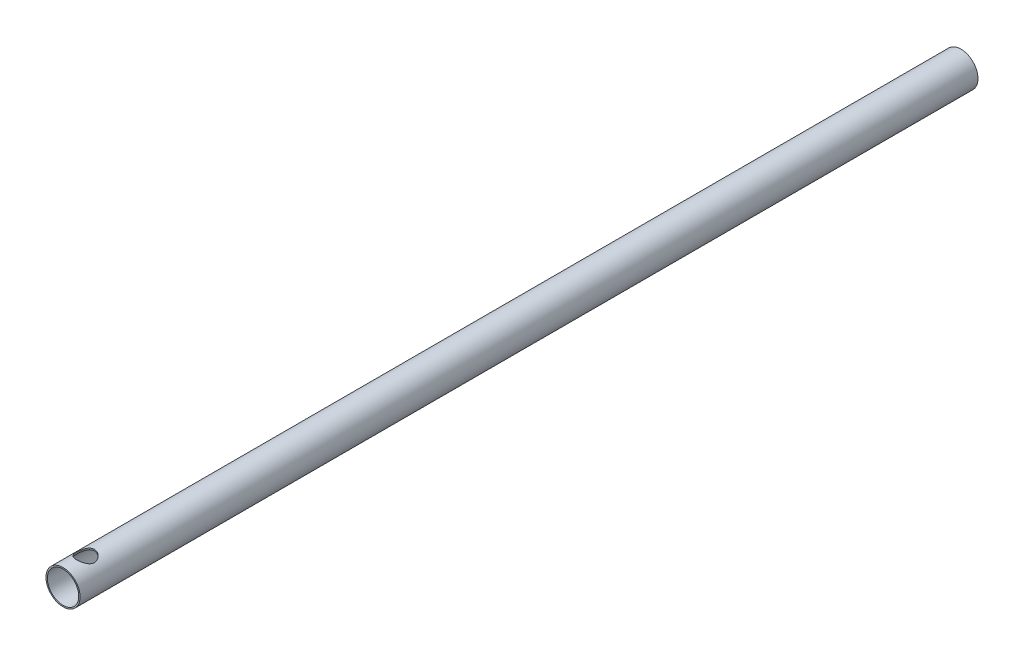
ISO-10303-21;
HEADER;
FILE_DESCRIPTION(('STEP AP214'),'2;1');
FILE_NAME('part.step','',(''),(''),'','','');
FILE_SCHEMA(('AUTOMOTIVE_DESIGN { 1 0 10303 214 1 1 1 1 }'));
ENDSEC;
DATA;
#1=APPLICATION_CONTEXT('core data for automotive mechanical design processes');
#2=APPLICATION_PROTOCOL_DEFINITION('international standard','automotive_design',2000,#1);
#3=PRODUCT_CONTEXT('',#1,'mechanical');
#4=PRODUCT('Part','Part','',(#3));
#5=PRODUCT_RELATED_PRODUCT_CATEGORY('part','',(#4));
#6=PRODUCT_DEFINITION_FORMATION('','',#4);
#7=PRODUCT_DEFINITION_CONTEXT('part definition',#1,'design');
#8=PRODUCT_DEFINITION('design','',#6,#7);
#9=PRODUCT_DEFINITION_SHAPE('','',#8);
#10=(LENGTH_UNIT() NAMED_UNIT(*) SI_UNIT(.MILLI.,.METRE.));
#11=(NAMED_UNIT(*) PLANE_ANGLE_UNIT() SI_UNIT($,.RADIAN.));
#12=(NAMED_UNIT(*) SI_UNIT($,.STERADIAN.) SOLID_ANGLE_UNIT());
#13=UNCERTAINTY_MEASURE_WITH_UNIT(LENGTH_MEASURE(1.E-05),#10,'distance_accuracy_value','');
#14=(GEOMETRIC_REPRESENTATION_CONTEXT(3) GLOBAL_UNCERTAINTY_ASSIGNED_CONTEXT((#13)) GLOBAL_UNIT_ASSIGNED_CONTEXT((#10,
#11,#12)) REPRESENTATION_CONTEXT('',''));
#15=CARTESIAN_POINT('',(0.,0.,0.));
#16=DIRECTION('',(0.,0.,1.));
#17=DIRECTION('',(1.,0.,0.));
#18=AXIS2_PLACEMENT_3D('',#15,#16,#17);
#19=CARTESIAN_POINT('',(0.,0.,2000.));
#20=DIRECTION('',(0.,0.,-1.));
#21=DIRECTION('',(-1.,0.,0.));
#22=AXIS2_PLACEMENT_3D('',#19,#20,#21);
#23=CYLINDRICAL_SURFACE('',#22,38.);
#24=CARTESIAN_POINT('',(0.,0.,0.));
#25=DIRECTION('',(0.,0.,1.));
#26=DIRECTION('',(1.,0.,0.));
#27=AXIS2_PLACEMENT_3D('',#24,#25,#26);
#28=CIRCLE('',#27,38.);
#29=CARTESIAN_POINT('',(38.,0.,0.));
#30=VERTEX_POINT('',#29);
#31=EDGE_CURVE('E44',#30,#30,#28,.T.);
#32=ORIENTED_EDGE('',*,*,#31,.T.);
#33=EDGE_LOOP('',(#32));
#34=FACE_BOUND('',#33,.T.);
#35=CARTESIAN_POINT('',(0.,0.,2000.));
#36=DIRECTION('',(0.,0.,1.));
#37=DIRECTION('',(1.,0.,0.));
#38=AXIS2_PLACEMENT_3D('',#35,#36,#37);
#39=CIRCLE('',#38,38.);
#40=CARTESIAN_POINT('',(38.,0.,2000.));
#41=VERTEX_POINT('',#40);
#42=EDGE_CURVE('E10',#41,#41,#39,.T.);
#43=ORIENTED_EDGE('',*,*,#42,.F.);
#44=EDGE_LOOP('',(#43));
#45=FACE_BOUND('',#44,.T.);
#46=CARTESIAN_POINT('',(0.,-38.,70.));
#47=CARTESIAN_POINT('',(0.522568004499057,-38.0000010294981,70.0000012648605));
#48=CARTESIAN_POINT('',(1.04512141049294,-37.9891975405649,69.9794979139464));
#49=CARTESIAN_POINT('',(2.08633632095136,-37.9462617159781,69.8977383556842));
#50=CARTESIAN_POINT('',(2.6049963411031,-37.914121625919,69.8364673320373));
#51=CARTESIAN_POINT('',(3.63502542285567,-37.8292749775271,69.6738114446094));
#52=CARTESIAN_POINT('',(4.14638298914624,-37.7765390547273,69.5723693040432));
#53=CARTESIAN_POINT('',(5.15735384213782,-37.6518407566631,69.330593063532));
#54=CARTESIAN_POINT('',(5.65696807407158,-37.5798799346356,69.1902621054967));
#55=CARTESIAN_POINT('',(6.63923087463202,-37.4188100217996,68.8728893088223));
#56=CARTESIAN_POINT('',(7.12193999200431,-37.3297716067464,68.6959985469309));
#57=CARTESIAN_POINT('',(8.0697120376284,-37.1364201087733,68.3068892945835));
#58=CARTESIAN_POINT('',(8.53477467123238,-37.0321067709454,68.09467021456));
#59=CARTESIAN_POINT('',(9.4447829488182,-36.8105334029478,67.6367656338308));
#60=CARTESIAN_POINT('',(9.88973164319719,-36.6932753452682,67.3910852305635));
#61=CARTESIAN_POINT('',(10.7575932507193,-36.4482858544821,66.8680445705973));
#62=CARTESIAN_POINT('',(11.1805042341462,-36.320553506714,66.590681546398));
#63=CARTESIAN_POINT('',(12.0292188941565,-36.0487047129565,65.9870688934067));
#64=CARTESIAN_POINT('',(12.4534290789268,-35.9040629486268,65.6588147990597));
#65=CARTESIAN_POINT('',(13.2730381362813,-35.6092147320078,64.9704013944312));
#66=CARTESIAN_POINT('',(13.6684359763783,-35.459008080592,64.6102409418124));
#67=CARTESIAN_POINT('',(14.4290489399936,-35.1563680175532,63.8595911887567));
#68=CARTESIAN_POINT('',(14.7942401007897,-35.0039329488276,63.4690782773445));
#69=CARTESIAN_POINT('',(15.492475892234,-34.7005492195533,62.6597340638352));
#70=CARTESIAN_POINT('',(15.8255189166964,-34.5496006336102,62.2409013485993));
#71=CARTESIAN_POINT('',(16.4857593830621,-34.239804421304,61.3384017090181));
#72=CARTESIAN_POINT('',(16.8098339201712,-34.0814391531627,60.8522769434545));
#73=CARTESIAN_POINT('',(17.4155484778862,-33.7759347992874,59.8509401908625));
#74=CARTESIAN_POINT('',(17.6971914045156,-33.6287949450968,59.3357301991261));
#75=CARTESIAN_POINT('',(18.2154176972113,-33.3509371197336,58.2791642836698));
#76=CARTESIAN_POINT('',(18.4520238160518,-33.2202108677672,57.7378217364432));
#77=CARTESIAN_POINT('',(18.8776468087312,-32.9802097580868,56.6321361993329));
#78=CARTESIAN_POINT('',(19.0666695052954,-32.870932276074,56.067796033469));
#79=CARTESIAN_POINT('',(19.3843303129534,-32.6845461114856,54.9559048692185));
#80=CARTESIAN_POINT('',(19.5159850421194,-32.6058633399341,54.4094813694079));
#81=CARTESIAN_POINT('',(19.7331690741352,-32.4748857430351,53.3043958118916));
#82=CARTESIAN_POINT('',(19.8187005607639,-32.4225896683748,52.745734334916));
#83=CARTESIAN_POINT('',(19.9421427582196,-32.3468115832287,51.6217980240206));
#84=CARTESIAN_POINT('',(19.9801023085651,-32.3233000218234,51.0565305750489));
#85=CARTESIAN_POINT('',(20.0078683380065,-32.3061220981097,49.9243891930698));
#86=CARTESIAN_POINT('',(19.9976803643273,-32.3124522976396,49.3575154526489));
#87=CARTESIAN_POINT('',(19.9340290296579,-32.3517469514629,48.3048610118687));
#88=CARTESIAN_POINT('',(19.8866518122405,-32.3809645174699,47.8185560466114));
#89=CARTESIAN_POINT('',(19.7567812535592,-32.4603665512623,46.8524464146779));
#90=CARTESIAN_POINT('',(19.6742916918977,-32.5105487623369,46.372641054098));
#91=CARTESIAN_POINT('',(19.475169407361,-32.6302195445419,45.4225008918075));
#92=CARTESIAN_POINT('',(19.3585261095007,-32.6997140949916,44.9521690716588));
#93=CARTESIAN_POINT('',(19.0923668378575,-32.8558259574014,44.02381933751));
#94=CARTESIAN_POINT('',(18.9428489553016,-32.9424442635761,43.5658021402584));
#95=CARTESIAN_POINT('',(18.6086346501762,-33.1324079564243,42.6542778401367));
#96=CARTESIAN_POINT('',(18.4232245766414,-33.2360848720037,42.2011021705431));
#97=CARTESIAN_POINT('',(18.0209519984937,-33.455908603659,41.3118728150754));
#98=CARTESIAN_POINT('',(17.804076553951,-33.5720605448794,40.8758262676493));
#99=CARTESIAN_POINT('',(17.3403773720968,-33.8138976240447,40.0226722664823));
#100=CARTESIAN_POINT('',(17.0935501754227,-33.9395838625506,39.6055670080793));
#101=CARTESIAN_POINT('',(16.5713418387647,-34.1975942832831,38.7917700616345));
#102=CARTESIAN_POINT('',(16.29595818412,-34.329919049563,38.3950801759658));
#103=CARTESIAN_POINT('',(15.6766918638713,-34.6175370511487,37.5683982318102));
#104=CARTESIAN_POINT('',(15.3286411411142,-34.773414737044,37.1417242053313));
#105=CARTESIAN_POINT('',(14.5987502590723,-35.0860960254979,36.3186592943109));
#106=CARTESIAN_POINT('',(14.2169073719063,-35.242899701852,35.9222708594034));
#107=CARTESIAN_POINT('',(13.4209777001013,-35.5536207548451,35.1615172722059));
#108=CARTESIAN_POINT('',(13.0068721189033,-35.7075363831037,34.7971710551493));
#109=CARTESIAN_POINT('',(12.1484933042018,-36.0086235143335,34.1028676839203));
#110=CARTESIAN_POINT('',(11.7042213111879,-36.1557952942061,33.7729091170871));
#111=CARTESIAN_POINT('',(10.7614843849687,-36.4478740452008,33.1318789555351));
#112=CARTESIAN_POINT('',(10.2613746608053,-36.5921777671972,32.8229440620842));
#113=CARTESIAN_POINT('',(9.23255288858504,-36.8652029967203,32.2487466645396));
#114=CARTESIAN_POINT('',(8.70383926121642,-36.9939236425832,31.9834865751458));
#115=CARTESIAN_POINT('',(7.62165916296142,-37.231935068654,31.4996939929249));
#116=CARTESIAN_POINT('',(7.06821023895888,-37.3412393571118,31.2811289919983));
#117=CARTESIAN_POINT('',(5.94042396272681,-37.5371649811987,30.893278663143));
#118=CARTESIAN_POINT('',(5.36608931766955,-37.6237892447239,30.7239869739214));
#119=CARTESIAN_POINT('',(4.25299571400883,-37.7650420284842,30.4497846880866));
#120=CARTESIAN_POINT('',(3.7155839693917,-37.8218230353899,30.3405036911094));
#121=CARTESIAN_POINT('',(2.63171485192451,-37.9126591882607,30.1663095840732));
#122=CARTESIAN_POINT('',(2.08525800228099,-37.9467156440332,30.1013939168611));
#123=CARTESIAN_POINT('',(0.988147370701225,-37.9911153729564,30.0168536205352));
#124=CARTESIAN_POINT('',(0.43749566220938,-38.0014696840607,29.9972079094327));
#125=CARTESIAN_POINT('',(-0.663464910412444,-37.9981943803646,30.0034303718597));
#126=CARTESIAN_POINT('',(-1.21377379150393,-37.9845660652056,30.0292960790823));
#127=CARTESIAN_POINT('',(-2.26105013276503,-37.9359706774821,30.1218906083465));
#128=CARTESIAN_POINT('',(-2.75845135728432,-37.9029862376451,30.1848245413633));
#129=CARTESIAN_POINT('',(-3.74553158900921,-37.8182010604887,30.3474898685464));
#130=CARTESIAN_POINT('',(-4.23521115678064,-37.7664016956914,30.4472185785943));
#131=CARTESIAN_POINT('',(-5.20369154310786,-37.6451830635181,30.6823927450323));
#132=CARTESIAN_POINT('',(-5.68249179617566,-37.5757628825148,30.8178400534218));
#133=CARTESIAN_POINT('',(-6.6263363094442,-37.4208553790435,31.1230907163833));
#134=CARTESIAN_POINT('',(-7.09137997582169,-37.3353673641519,31.2928955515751));
#135=CARTESIAN_POINT('',(-8.01696491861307,-37.1477720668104,31.6701218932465));
#136=CARTESIAN_POINT('',(-8.47708122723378,-37.0452932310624,31.8784001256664));
#137=CARTESIAN_POINT('',(-9.37784971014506,-36.8275802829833,32.3277255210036));
#138=CARTESIAN_POINT('',(-9.81850176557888,-36.712346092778,32.568772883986));
#139=CARTESIAN_POINT('',(-10.6784956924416,-36.4714847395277,33.081946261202));
#140=CARTESIAN_POINT('',(-11.0978315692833,-36.3458546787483,33.3540809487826));
#141=CARTESIAN_POINT('',(-11.9133995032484,-36.0867570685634,33.9276788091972));
#142=CARTESIAN_POINT('',(-12.3096295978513,-35.9532888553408,34.2291444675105));
#143=CARTESIAN_POINT('',(-13.118135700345,-35.6667544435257,34.8931692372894));
#144=CARTESIAN_POINT('',(-13.5276736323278,-35.5131088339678,35.2588175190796));
#145=CARTESIAN_POINT('',(-14.3148419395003,-35.2031857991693,36.0219497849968));
#146=CARTESIAN_POINT('',(-14.6924702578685,-35.0469082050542,36.4194358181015));
#147=CARTESIAN_POINT('',(-15.4144058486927,-34.7354392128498,37.2447328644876));
#148=CARTESIAN_POINT('',(-15.7586848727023,-34.5802488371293,37.6725690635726));
#149=CARTESIAN_POINT('',(-16.2483632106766,-34.3514656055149,38.3352601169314));
#150=CARTESIAN_POINT('',(-16.4071375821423,-34.2758690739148,38.5596546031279));
#151=CARTESIAN_POINT('',(-16.7156195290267,-34.1264917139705,39.0152933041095));
#152=CARTESIAN_POINT('',(-16.865324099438,-34.0527114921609,39.2465397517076));
#153=CARTESIAN_POINT('',(-17.3187104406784,-33.8257469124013,39.9797229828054));
#154=CARTESIAN_POINT('',(-17.6059607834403,-33.6766990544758,40.4932612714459));
#155=CARTESIAN_POINT('',(-18.1355331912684,-33.3944990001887,41.5471839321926));
#156=CARTESIAN_POINT('',(-18.3778604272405,-33.2613449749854,42.0875652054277));
#157=CARTESIAN_POINT('',(-18.7055195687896,-33.0774724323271,42.9153989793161));
#158=CARTESIAN_POINT('',(-18.8087394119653,-33.0188412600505,43.1941265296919));
#159=CARTESIAN_POINT('',(-19.0029471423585,-32.9074536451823,43.7568750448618));
#160=CARTESIAN_POINT('',(-19.0939381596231,-32.854695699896,44.0408946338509));
#161=CARTESIAN_POINT('',(-19.3480848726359,-32.706121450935,44.90018587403));
#162=CARTESIAN_POINT('',(-19.4924876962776,-32.6199629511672,45.4828751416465));
#163=CARTESIAN_POINT('',(-19.7171345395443,-32.484612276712,46.6045430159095));
#164=CARTESIAN_POINT('',(-19.8022756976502,-32.4326268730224,47.1422161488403));
#165=CARTESIAN_POINT('',(-19.9284928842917,-32.3552271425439,48.224639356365));
#166=CARTESIAN_POINT('',(-19.9695720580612,-32.3298109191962,48.7693889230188));
#167=CARTESIAN_POINT('',(-20.0069633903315,-32.3066850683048,49.8607156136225));
#168=CARTESIAN_POINT('',(-20.0032991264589,-32.308960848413,50.4072916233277));
#169=CARTESIAN_POINT('',(-19.9513233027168,-32.3410828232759,51.4974777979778));
#170=CARTESIAN_POINT('',(-19.9030144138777,-32.3709273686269,52.0410881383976));
#171=CARTESIAN_POINT('',(-19.7707153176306,-32.4518718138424,53.057844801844));
#172=CARTESIAN_POINT('',(-19.6915103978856,-32.5001067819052,53.5318546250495));
#173=CARTESIAN_POINT('',(-19.4998061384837,-32.615488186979,54.4706892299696));
#174=CARTESIAN_POINT('',(-19.3873100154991,-32.6826327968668,54.9355148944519));
#175=CARTESIAN_POINT('',(-19.1301862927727,-32.8337962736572,55.8534831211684));
#176=CARTESIAN_POINT('',(-18.9855501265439,-32.917819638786,56.3066225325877));
#177=CARTESIAN_POINT('',(-18.6654939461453,-33.1003511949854,57.1988904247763));
#178=CARTESIAN_POINT('',(-18.4900717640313,-33.1988604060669,57.638017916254));
#179=CARTESIAN_POINT('',(-18.0974342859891,-33.4146111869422,58.5284703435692));
#180=CARTESIAN_POINT('',(-17.8782417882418,-33.5326547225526,58.9787285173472));
#181=CARTESIAN_POINT('',(-17.4080114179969,-33.7791595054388,59.8595393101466));
#182=CARTESIAN_POINT('',(-17.1569598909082,-33.9076252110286,60.2900833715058));
#183=CARTESIAN_POINT('',(-16.6245349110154,-34.17181815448,61.1297814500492));
#184=CARTESIAN_POINT('',(-16.343154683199,-34.3075470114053,61.538930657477));
#185=CARTESIAN_POINT('',(-15.7515187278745,-34.5831776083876,62.3343166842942));
#186=CARTESIAN_POINT('',(-15.4412609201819,-34.7230796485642,62.7205518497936));
#187=CARTESIAN_POINT('',(-14.7478846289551,-35.0237332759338,63.5210233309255));
#188=CARTESIAN_POINT('',(-14.3606431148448,-35.1846664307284,63.9316302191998));
#189=CARTESIAN_POINT('',(-13.5522615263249,-35.5038740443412,64.7191944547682));
#190=CARTESIAN_POINT('',(-13.1311183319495,-35.6621482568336,65.0961486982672));
#191=CARTESIAN_POINT('',(-12.2566368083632,-35.9720746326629,65.8143978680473));
#192=CARTESIAN_POINT('',(-11.8032774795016,-36.1237223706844,66.1556691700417));
#193=CARTESIAN_POINT('',(-10.8668342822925,-36.4163771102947,66.799846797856));
#194=CARTESIAN_POINT('',(-10.3837517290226,-36.5573845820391,67.1027548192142));
#195=CARTESIAN_POINT('',(-9.38030968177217,-36.8277772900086,67.6734153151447));
#196=CARTESIAN_POINT('',(-8.85939241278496,-36.9568683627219,67.9403289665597));
#197=CARTESIAN_POINT('',(-7.7924726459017,-37.1964551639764,68.4288254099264));
#198=CARTESIAN_POINT('',(-7.24646668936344,-37.3069483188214,68.6504019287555));
#199=CARTESIAN_POINT('',(-6.13474088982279,-37.505773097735,69.0449994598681));
#200=CARTESIAN_POINT('',(-5.569071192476,-37.5941569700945,69.2181350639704));
#201=CARTESIAN_POINT('',(-4.42176129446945,-37.7462921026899,69.5140642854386));
#202=CARTESIAN_POINT('',(-3.84013034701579,-37.8100573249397,69.6368864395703));
#203=CARTESIAN_POINT('',(-2.71700213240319,-37.9065630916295,69.8220373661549));
#204=CARTESIAN_POINT('',(-2.17640459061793,-37.9415165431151,69.8886923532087));
#205=CARTESIAN_POINT('',(-1.09053279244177,-37.9882346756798,69.9776734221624));
#206=CARTESIAN_POINT('',(-0.545258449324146,-37.9999989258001,69.999998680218));
#207=CARTESIAN_POINT('',(0.,-38.,70.));
#208=B_SPLINE_CURVE_WITH_KNOTS('',3,(#46,#47,#48,#49,#50,#51,#52,#53,#54,#55,#56,#57,#58,#59,
#60,#61,#62,#63,#64,#65,#66,#67,#68,#69,#70,#71,#72,#73,#74,#75,#76,#77,#78,#79,#80,#81,#82,#83,
#84,#85,#86,#87,#88,#89,#90,#91,#92,#93,#94,#95,#96,#97,#98,#99,#100,#101,#102,#103,#104,#105,
#106,#107,#108,#109,#110,#111,#112,#113,#114,#115,#116,#117,#118,#119,#120,#121,#122,#123,#124,
#125,#126,#127,#128,#129,#130,#131,#132,#133,#134,#135,#136,#137,#138,#139,#140,#141,#142,#143,
#144,#145,#146,#147,#148,#149,#150,#151,#152,#153,#154,#155,#156,#157,#158,#159,#160,#161,#162,
#163,#164,#165,#166,#167,#168,#169,#170,#171,#172,#173,#174,#175,#176,#177,#178,#179,#180,#181,
#182,#183,#184,#185,#186,#187,#188,#189,#190,#191,#192,#193,#194,#195,#196,#197,#198,#199,#200,
#201,#202,#203,#204,#205,#206,#207),.UNSPECIFIED.,.T.,.F.,(4,2,2,2,2,2,2,2,2,2,2,2,2,2,2,2,2,2,
2,2,2,2,2,2,2,2,2,2,2,2,2,2,2,2,2,2,2,2,2,2,2,2,2,2,2,2,2,2,2,2,2,2,2,2,2,2,2,2,2,2,2,2,2,2,2,2,
2,2,2,2,2,2,2,2,2,2,2,2,2,2,4),(0.,1.56716893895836,3.13490774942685,4.70488996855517,
6.27474538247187,7.83823890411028,9.40175852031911,10.9650402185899,12.5284585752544,
14.1933404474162,15.8582819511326,17.5245318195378,19.1908648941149,21.0045937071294,
22.8181982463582,24.6308840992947,26.4433480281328,28.1434697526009,29.8435109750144,
31.5418054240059,33.2399042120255,34.7066096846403,36.1731573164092,37.6401595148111,
39.1072469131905,40.607231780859,42.1078352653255,43.6086122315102,45.1095214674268,
46.8244665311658,48.5395501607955,50.2556405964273,51.9716605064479,53.785131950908,
55.5987036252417,57.4110085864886,59.2230794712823,60.8748553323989,62.5265359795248,
64.1774472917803,65.8282691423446,67.3338684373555,68.8393579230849,70.3449254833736,
71.8505579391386,73.3949963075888,74.9394441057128,76.4843238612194,78.02933464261,
79.7378184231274,81.446412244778,83.1564408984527,84.0115135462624,84.8668679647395,
86.6853651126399,88.503652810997,89.4122023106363,90.320518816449,92.1365438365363,
93.7747796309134,95.4128984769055,97.0501541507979,98.6873118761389,100.134691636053,
101.581931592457,103.029557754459,104.477285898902,106.019254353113,107.56188593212,
109.104862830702,110.647950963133,112.406673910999,114.16555889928,115.925601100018,
117.685565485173,119.481269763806,121.277222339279,123.068889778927,124.859539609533,
126.494726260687,128.129943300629),.UNSPECIFIED.);
#209=CARTESIAN_POINT('',(0.,-38.,70.));
#210=VERTEX_POINT('',#209);
#211=EDGE_CURVE('E59',#210,#210,#208,.T.);
#212=ORIENTED_EDGE('',*,*,#211,.T.);
#213=EDGE_LOOP('',(#212));
#214=FACE_BOUND('',#213,.T.);
#215=CARTESIAN_POINT('',(0.,38.,1930.));
#216=CARTESIAN_POINT('',(-0.522568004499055,38.0000010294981,1929.99999873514));
#217=CARTESIAN_POINT('',(-1.04512141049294,37.9891975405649,1930.02050208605));
#218=CARTESIAN_POINT('',(-2.08633632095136,37.9462617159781,1930.10226164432));
#219=CARTESIAN_POINT('',(-2.60499634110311,37.914121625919,1930.16353266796));
#220=CARTESIAN_POINT('',(-3.63502542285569,37.8292749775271,1930.32618855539));
#221=CARTESIAN_POINT('',(-4.14638298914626,37.7765390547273,1930.42763069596));
#222=CARTESIAN_POINT('',(-5.15735384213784,37.6518407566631,1930.66940693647));
#223=CARTESIAN_POINT('',(-5.6569680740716,37.5798799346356,1930.8097378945));
#224=CARTESIAN_POINT('',(-6.63923087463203,37.4188100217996,1931.12711069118));
#225=CARTESIAN_POINT('',(-7.12193999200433,37.3297716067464,1931.30400145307));
#226=CARTESIAN_POINT('',(-8.06971203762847,37.1364201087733,1931.69311070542));
#227=CARTESIAN_POINT('',(-8.5347746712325,37.0321067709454,1931.90532978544));
#228=CARTESIAN_POINT('',(-9.44478294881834,36.8105334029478,1932.36323436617));
#229=CARTESIAN_POINT('',(-9.88973164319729,36.6932753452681,1932.60891476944));
#230=CARTESIAN_POINT('',(-10.7575932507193,36.4482858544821,1933.1319554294));
#231=CARTESIAN_POINT('',(-11.1805042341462,36.320553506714,1933.4093184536));
#232=CARTESIAN_POINT('',(-12.0292188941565,36.0487047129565,1934.01293110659));
#233=CARTESIAN_POINT('',(-12.4534290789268,35.9040629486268,1934.34118520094));
#234=CARTESIAN_POINT('',(-13.2730381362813,35.6092147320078,1935.02959860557));
#235=CARTESIAN_POINT('',(-13.6684359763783,35.459008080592,1935.38975905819));
#236=CARTESIAN_POINT('',(-14.4290489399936,35.1563680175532,1936.14040881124));
#237=CARTESIAN_POINT('',(-14.7942401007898,35.0039329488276,1936.53092172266));
#238=CARTESIAN_POINT('',(-15.4924758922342,34.7005492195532,1937.34026593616));
#239=CARTESIAN_POINT('',(-15.8255189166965,34.5496006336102,1937.7590986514));
#240=CARTESIAN_POINT('',(-16.485759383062,34.239804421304,1938.66159829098));
#241=CARTESIAN_POINT('',(-16.8098339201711,34.0814391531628,1939.14772305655));
#242=CARTESIAN_POINT('',(-17.4155484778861,33.7759347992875,1940.14905980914));
#243=CARTESIAN_POINT('',(-17.6971914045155,33.6287949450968,1940.66426980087));
#244=CARTESIAN_POINT('',(-18.2154176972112,33.3509371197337,1941.72083571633));
#245=CARTESIAN_POINT('',(-18.4520238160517,33.2202108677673,1942.26217826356));
#246=CARTESIAN_POINT('',(-18.8776468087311,32.9802097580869,1943.36786380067));
#247=CARTESIAN_POINT('',(-19.0666695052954,32.870932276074,1943.93220396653));
#248=CARTESIAN_POINT('',(-19.3843303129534,32.6845461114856,1945.04409513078));
#249=CARTESIAN_POINT('',(-19.5159850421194,32.605863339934,1945.59051863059));
#250=CARTESIAN_POINT('',(-19.7331690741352,32.4748857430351,1946.69560418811));
#251=CARTESIAN_POINT('',(-19.8187005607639,32.4225896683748,1947.25426566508));
#252=CARTESIAN_POINT('',(-19.9421427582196,32.3468115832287,1948.37820197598));
#253=CARTESIAN_POINT('',(-19.9801023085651,32.3233000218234,1948.94346942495));
#254=CARTESIAN_POINT('',(-20.0078683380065,32.3061220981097,1950.07561080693));
#255=CARTESIAN_POINT('',(-19.9976803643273,32.3124522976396,1950.64248454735));
#256=CARTESIAN_POINT('',(-19.934029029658,32.3517469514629,1951.69513898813));
#257=CARTESIAN_POINT('',(-19.8866518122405,32.3809645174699,1952.18144395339));
#258=CARTESIAN_POINT('',(-19.7567812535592,32.4603665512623,1953.14755358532));
#259=CARTESIAN_POINT('',(-19.6742916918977,32.5105487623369,1953.6273589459));
#260=CARTESIAN_POINT('',(-19.4751694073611,32.6302195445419,1954.57749910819));
#261=CARTESIAN_POINT('',(-19.3585261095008,32.6997140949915,1955.04783092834));
#262=CARTESIAN_POINT('',(-19.0923668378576,32.8558259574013,1955.97618066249));
#263=CARTESIAN_POINT('',(-18.9428489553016,32.942444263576,1956.43419785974));
#264=CARTESIAN_POINT('',(-18.6086346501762,33.1324079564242,1957.34572215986));
#265=CARTESIAN_POINT('',(-18.4232245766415,33.2360848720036,1957.79889782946));
#266=CARTESIAN_POINT('',(-18.0209519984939,33.4559086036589,1958.68812718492));
#267=CARTESIAN_POINT('',(-17.8040765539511,33.5720605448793,1959.12417373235));
#268=CARTESIAN_POINT('',(-17.3403773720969,33.8138976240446,1959.97732773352));
#269=CARTESIAN_POINT('',(-17.0935501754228,33.9395838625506,1960.39443299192));
#270=CARTESIAN_POINT('',(-16.5713418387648,34.197594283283,1961.20822993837));
#271=CARTESIAN_POINT('',(-16.2959581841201,34.3299190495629,1961.60491982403));
#272=CARTESIAN_POINT('',(-15.6766918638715,34.6175370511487,1962.43160176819));
#273=CARTESIAN_POINT('',(-15.3286411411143,34.773414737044,1962.85827579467));
#274=CARTESIAN_POINT('',(-14.5987502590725,35.0860960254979,1963.68134070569));
#275=CARTESIAN_POINT('',(-14.2169073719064,35.2428997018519,1964.0777291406));
#276=CARTESIAN_POINT('',(-13.4209777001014,35.5536207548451,1964.83848272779));
#277=CARTESIAN_POINT('',(-13.0068721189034,35.7075363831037,1965.20282894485));
#278=CARTESIAN_POINT('',(-12.1484933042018,36.0086235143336,1965.89713231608));
#279=CARTESIAN_POINT('',(-11.7042213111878,36.1557952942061,1966.22709088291));
#280=CARTESIAN_POINT('',(-10.7614843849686,36.4478740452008,1966.86812104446));
#281=CARTESIAN_POINT('',(-10.2613746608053,36.5921777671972,1967.17705593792));
#282=CARTESIAN_POINT('',(-9.23255288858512,36.8652029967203,1967.75125333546));
#283=CARTESIAN_POINT('',(-8.70383926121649,36.9939236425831,1968.01651342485));
#284=CARTESIAN_POINT('',(-7.62165916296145,37.231935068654,1968.50030600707));
#285=CARTESIAN_POINT('',(-7.06821023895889,37.3412393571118,1968.718871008));
#286=CARTESIAN_POINT('',(-5.9404239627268,37.5371649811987,1969.10672133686));
#287=CARTESIAN_POINT('',(-5.36608931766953,37.6237892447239,1969.27601302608));
#288=CARTESIAN_POINT('',(-4.25299571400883,37.7650420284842,1969.55021531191));
#289=CARTESIAN_POINT('',(-3.71558396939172,37.8218230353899,1969.65949630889));
#290=CARTESIAN_POINT('',(-2.63171485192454,37.9126591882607,1969.83369041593));
#291=CARTESIAN_POINT('',(-2.08525800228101,37.9467156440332,1969.89860608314));
#292=CARTESIAN_POINT('',(-0.988147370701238,37.9911153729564,1969.98314637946));
#293=CARTESIAN_POINT('',(-0.437495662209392,38.0014696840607,1970.00279209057));
#294=CARTESIAN_POINT('',(0.663464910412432,37.9981943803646,1969.99656962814));
#295=CARTESIAN_POINT('',(1.21377379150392,37.9845660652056,1969.97070392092));
#296=CARTESIAN_POINT('',(2.26105013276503,37.9359706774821,1969.87810939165));
#297=CARTESIAN_POINT('',(2.75845135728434,37.9029862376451,1969.81517545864));
#298=CARTESIAN_POINT('',(3.74553158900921,37.8182010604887,1969.65251013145));
#299=CARTESIAN_POINT('',(4.23521115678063,37.7664016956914,1969.55278142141));
#300=CARTESIAN_POINT('',(5.20369154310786,37.6451830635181,1969.31760725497));
#301=CARTESIAN_POINT('',(5.68249179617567,37.5757628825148,1969.18215994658));
#302=CARTESIAN_POINT('',(6.62633630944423,37.4208553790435,1968.87690928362));
#303=CARTESIAN_POINT('',(7.09137997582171,37.3353673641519,1968.70710444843));
#304=CARTESIAN_POINT('',(8.0169649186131,37.1477720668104,1968.32987810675));
#305=CARTESIAN_POINT('',(8.47708122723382,37.0452932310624,1968.12159987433));
#306=CARTESIAN_POINT('',(9.37784971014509,36.8275802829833,1967.672274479));
#307=CARTESIAN_POINT('',(9.8185017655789,36.712346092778,1967.43122711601));
#308=CARTESIAN_POINT('',(10.6784956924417,36.4714847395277,1966.9180537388));
#309=CARTESIAN_POINT('',(11.0978315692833,36.3458546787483,1966.64591905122));
#310=CARTESIAN_POINT('',(11.9133995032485,36.0867570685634,1966.0723211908));
#311=CARTESIAN_POINT('',(12.3096295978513,35.9532888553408,1965.77085553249));
#312=CARTESIAN_POINT('',(13.118135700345,35.6667544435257,1965.10683076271));
#313=CARTESIAN_POINT('',(13.5276736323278,35.5131088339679,1964.74118248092));
#314=CARTESIAN_POINT('',(14.3148419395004,35.2031857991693,1963.978050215));
#315=CARTESIAN_POINT('',(14.6924702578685,35.0469082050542,1963.5805641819));
#316=CARTESIAN_POINT('',(15.4144058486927,34.7354392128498,1962.75526713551));
#317=CARTESIAN_POINT('',(15.7586848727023,34.5802488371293,1962.32743093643));
#318=CARTESIAN_POINT('',(16.2483632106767,34.3514656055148,1961.66473988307));
#319=CARTESIAN_POINT('',(16.4071375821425,34.2758690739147,1961.44034539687));
#320=CARTESIAN_POINT('',(16.7156195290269,34.1264917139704,1960.98470669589));
#321=CARTESIAN_POINT('',(16.865324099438,34.0527114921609,1960.75346024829));
#322=CARTESIAN_POINT('',(17.3187104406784,33.8257469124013,1960.02027701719));
#323=CARTESIAN_POINT('',(17.6059607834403,33.6766990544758,1959.50673872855));
#324=CARTESIAN_POINT('',(18.1355331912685,33.3944990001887,1958.45281606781));
#325=CARTESIAN_POINT('',(18.3778604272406,33.2613449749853,1957.91243479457));
#326=CARTESIAN_POINT('',(18.7055195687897,33.0774724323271,1957.08460102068));
#327=CARTESIAN_POINT('',(18.8087394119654,33.0188412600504,1956.80587347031));
#328=CARTESIAN_POINT('',(19.0029471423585,32.9074536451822,1956.24312495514));
#329=CARTESIAN_POINT('',(19.0939381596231,32.854695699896,1955.95910536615));
#330=CARTESIAN_POINT('',(19.3480848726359,32.706121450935,1955.09981412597));
#331=CARTESIAN_POINT('',(19.4924876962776,32.6199629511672,1954.51712485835));
#332=CARTESIAN_POINT('',(19.7171345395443,32.484612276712,1953.39545698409));
#333=CARTESIAN_POINT('',(19.8022756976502,32.4326268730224,1952.85778385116));
#334=CARTESIAN_POINT('',(19.9284928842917,32.3552271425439,1951.77536064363));
#335=CARTESIAN_POINT('',(19.9695720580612,32.3298109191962,1951.23061107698));
#336=CARTESIAN_POINT('',(20.0069633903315,32.3066850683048,1950.13928438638));
#337=CARTESIAN_POINT('',(20.0032991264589,32.308960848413,1949.59270837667));
#338=CARTESIAN_POINT('',(19.9513233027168,32.3410828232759,1948.50252220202));
#339=CARTESIAN_POINT('',(19.9030144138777,32.3709273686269,1947.9589118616));
#340=CARTESIAN_POINT('',(19.7707153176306,32.4518718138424,1946.94215519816));
#341=CARTESIAN_POINT('',(19.6915103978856,32.5001067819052,1946.46814537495));
#342=CARTESIAN_POINT('',(19.4998061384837,32.615488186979,1945.52931077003));
#343=CARTESIAN_POINT('',(19.3873100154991,32.6826327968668,1945.06448510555));
#344=CARTESIAN_POINT('',(19.1301862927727,32.8337962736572,1944.14651687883));
#345=CARTESIAN_POINT('',(18.985550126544,32.9178196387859,1943.69337746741));
#346=CARTESIAN_POINT('',(18.6654939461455,33.1003511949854,1942.80110957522));
#347=CARTESIAN_POINT('',(18.4900717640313,33.1988604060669,1942.36198208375));
#348=CARTESIAN_POINT('',(18.0974342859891,33.4146111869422,1941.47152965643));
#349=CARTESIAN_POINT('',(17.8782417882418,33.5326547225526,1941.02127148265));
#350=CARTESIAN_POINT('',(17.4080114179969,33.7791595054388,1940.14046068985));
#351=CARTESIAN_POINT('',(17.1569598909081,33.9076252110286,1939.70991662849));
#352=CARTESIAN_POINT('',(16.6245349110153,34.17181815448,1938.87021854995));
#353=CARTESIAN_POINT('',(16.3431546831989,34.3075470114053,1938.46106934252));
#354=CARTESIAN_POINT('',(15.7515187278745,34.5831776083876,1937.66568331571));
#355=CARTESIAN_POINT('',(15.4412609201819,34.7230796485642,1937.27944815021));
#356=CARTESIAN_POINT('',(14.747884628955,35.0237332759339,1936.47897666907));
#357=CARTESIAN_POINT('',(14.3606431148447,35.1846664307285,1936.0683697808));
#358=CARTESIAN_POINT('',(13.5522615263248,35.5038740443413,1935.28080554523));
#359=CARTESIAN_POINT('',(13.1311183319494,35.6621482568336,1934.90385130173));
#360=CARTESIAN_POINT('',(12.2566368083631,35.972074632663,1934.18560213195));
#361=CARTESIAN_POINT('',(11.8032774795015,36.1237223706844,1933.84433082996));
#362=CARTESIAN_POINT('',(10.8668342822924,36.4163771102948,1933.20015320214));
#363=CARTESIAN_POINT('',(10.3837517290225,36.5573845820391,1932.89724518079));
#364=CARTESIAN_POINT('',(9.38030968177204,36.8277772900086,1932.32658468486));
#365=CARTESIAN_POINT('',(8.8593924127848,36.956868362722,1932.05967103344));
#366=CARTESIAN_POINT('',(7.79247264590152,37.1964551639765,1931.57117459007));
#367=CARTESIAN_POINT('',(7.24646668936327,37.3069483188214,1931.34959807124));
#368=CARTESIAN_POINT('',(6.13474088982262,37.5057730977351,1930.95500054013));
#369=CARTESIAN_POINT('',(5.56907119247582,37.5941569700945,1930.78186493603));
#370=CARTESIAN_POINT('',(4.4217612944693,37.7462921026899,1930.48593571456));
#371=CARTESIAN_POINT('',(3.84013034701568,37.8100573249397,1930.36311356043));
#372=CARTESIAN_POINT('',(2.71700213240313,37.9065630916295,1930.17796263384));
#373=CARTESIAN_POINT('',(2.17640459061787,37.9415165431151,1930.11130764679));
#374=CARTESIAN_POINT('',(1.09053279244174,37.9882346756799,1930.02232657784));
#375=CARTESIAN_POINT('',(0.54525844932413,37.9999989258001,1930.00000131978));
#376=CARTESIAN_POINT('',(0.,38.,1930.));
#377=B_SPLINE_CURVE_WITH_KNOTS('',3,(#215,#216,#217,#218,#219,#220,#221,#222,#223,#224,#225,
#226,#227,#228,#229,#230,#231,#232,#233,#234,#235,#236,#237,#238,#239,#240,#241,#242,#243,#244,
#245,#246,#247,#248,#249,#250,#251,#252,#253,#254,#255,#256,#257,#258,#259,#260,#261,#262,#263,
#264,#265,#266,#267,#268,#269,#270,#271,#272,#273,#274,#275,#276,#277,#278,#279,#280,#281,#282,
#283,#284,#285,#286,#287,#288,#289,#290,#291,#292,#293,#294,#295,#296,#297,#298,#299,#300,#301,
#302,#303,#304,#305,#306,#307,#308,#309,#310,#311,#312,#313,#314,#315,#316,#317,#318,#319,#320,
#321,#322,#323,#324,#325,#326,#327,#328,#329,#330,#331,#332,#333,#334,#335,#336,#337,#338,#339,
#340,#341,#342,#343,#344,#345,#346,#347,#348,#349,#350,#351,#352,#353,#354,#355,#356,#357,#358,
#359,#360,#361,#362,#363,#364,#365,#366,#367,#368,#369,#370,#371,#372,#373,#374,#375,#376),
.UNSPECIFIED.,.T.,.F.,(4,2,2,2,2,2,2,2,2,2,2,2,2,2,2,2,2,2,2,2,2,2,2,2,2,2,2,2,2,2,2,2,2,2,2,2,
2,2,2,2,2,2,2,2,2,2,2,2,2,2,2,2,2,2,2,2,2,2,2,2,2,2,2,2,2,2,2,2,2,2,2,2,2,2,2,2,2,2,2,2,4),(0.,
1.56716893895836,3.13490774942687,4.70488996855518,6.27474538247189,7.83823890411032,
9.40175852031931,10.9650402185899,12.5284585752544,14.1933404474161,15.8582819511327,
17.524531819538,19.190864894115,21.0045937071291,22.8181982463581,24.6308840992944,
26.443348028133,28.1434697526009,29.8435109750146,31.5418054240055,33.2399042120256,
34.7066096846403,36.1731573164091,37.6401595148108,39.1072469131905,40.6072317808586,
42.1078352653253,43.60861223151,45.1095214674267,46.8244665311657,48.5395501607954,
50.2556405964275,51.9716605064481,53.785131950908,55.5987036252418,57.4110085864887,
59.2230794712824,60.8748553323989,62.5265359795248,64.1774472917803,65.8282691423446,
67.3338684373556,68.8393579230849,70.3449254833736,71.8505579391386,73.394996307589,
74.9394441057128,76.4843238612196,78.0293346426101,79.7378184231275,81.446412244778,
83.1564408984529,84.0115135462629,84.8668679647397,86.68536511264,88.5036528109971,
89.4122023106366,90.320518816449,92.1365438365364,93.7747796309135,95.4128984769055,
97.0501541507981,98.6873118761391,100.134691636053,101.581931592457,103.029557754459,
104.477285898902,106.019254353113,107.561885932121,109.104862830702,110.647950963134,
112.406673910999,114.165558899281,115.925601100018,117.685565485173,119.481269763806,
121.277222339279,123.068889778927,124.859539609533,126.494726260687,128.129943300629),.UNSPECIFIED.);
#378=CARTESIAN_POINT('',(0.,38.,1930.));
#379=VERTEX_POINT('',#378);
#380=EDGE_CURVE('E60',#379,#379,#377,.T.);
#381=ORIENTED_EDGE('',*,*,#380,.F.);
#382=EDGE_LOOP('',(#381));
#383=FACE_BOUND('',#382,.T.);
#384=ADVANCED_FACE('F32',(#34,#45,#214,#383),#23,.T.);
#385=CARTESIAN_POINT('',(0.,0.,2000.));
#386=DIRECTION('',(0.,0.,-1.));
#387=DIRECTION('',(-1.,0.,0.));
#388=AXIS2_PLACEMENT_3D('',#385,#386,#387);
#389=CYLINDRICAL_SURFACE('',#388,35.);
#390=CARTESIAN_POINT('',(0.,0.,0.));
#391=DIRECTION('',(0.,0.,1.));
#392=DIRECTION('',(1.,0.,0.));
#393=AXIS2_PLACEMENT_3D('',#390,#391,#392);
#394=CIRCLE('',#393,35.);
#395=CARTESIAN_POINT('',(35.,0.,0.));
#396=VERTEX_POINT('',#395);
#397=EDGE_CURVE('E52',#396,#396,#394,.T.);
#398=ORIENTED_EDGE('',*,*,#397,.F.);
#399=EDGE_LOOP('',(#398));
#400=FACE_BOUND('',#399,.T.);
#401=CARTESIAN_POINT('',(0.,0.,2000.));
#402=DIRECTION('',(0.,0.,1.));
#403=DIRECTION('',(1.,0.,0.));
#404=AXIS2_PLACEMENT_3D('',#401,#402,#403);
#405=CIRCLE('',#404,35.);
#406=CARTESIAN_POINT('',(35.,0.,2000.));
#407=VERTEX_POINT('',#406);
#408=EDGE_CURVE('E49',#407,#407,#405,.T.);
#409=ORIENTED_EDGE('',*,*,#408,.T.);
#410=EDGE_LOOP('',(#409));
#411=FACE_BOUND('',#410,.T.);
#412=CARTESIAN_POINT('',(0.,-35.,70.));
#413=CARTESIAN_POINT('',(0.515871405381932,-34.9999959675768,69.9999955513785));
#414=CARTESIAN_POINT('',(1.03190267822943,-34.988564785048,69.9800092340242));
#415=CARTESIAN_POINT('',(2.06011319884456,-34.9431121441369,69.9003046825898));
#416=CARTESIAN_POINT('',(2.5722898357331,-34.9090765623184,69.8405616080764));
#417=CARTESIAN_POINT('',(3.58981233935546,-34.8191709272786,69.6819446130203));
#418=CARTESIAN_POINT('',(4.09513994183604,-34.7632512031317,69.5829816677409));
#419=CARTESIAN_POINT('',(5.09403689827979,-34.6309778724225,69.3471997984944));
#420=CARTESIAN_POINT('',(5.58760797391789,-34.554627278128,69.2103864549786));
#421=CARTESIAN_POINT('',(6.55755142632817,-34.3837155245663,68.9012273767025));
#422=CARTESIAN_POINT('',(7.03399459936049,-34.2892429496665,68.729054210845));
#423=CARTESIAN_POINT('',(7.96945341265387,-34.08397218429,68.3505432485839));
#424=CARTESIAN_POINT('',(8.42846847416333,-33.9731734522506,68.1442043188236));
#425=CARTESIAN_POINT('',(9.32659458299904,-33.7376656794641,67.6993130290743));
#426=CARTESIAN_POINT('',(9.76571435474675,-33.61296282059,67.4607749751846));
#427=CARTESIAN_POINT('',(10.6224344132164,-33.3521280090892,66.9532249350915));
#428=CARTESIAN_POINT('',(11.0400326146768,-33.2159949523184,66.684210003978));
#429=CARTESIAN_POINT('',(11.8814542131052,-32.924812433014,66.0969846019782));
#430=CARTESIAN_POINT('',(12.3035506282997,-32.7691068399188,65.7766246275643));
#431=CARTESIAN_POINT('',(13.1195611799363,-32.4510233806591,65.1048485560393));
#432=CARTESIAN_POINT('',(13.5134741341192,-32.288645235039,64.7534311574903));
#433=CARTESIAN_POINT('',(14.2720849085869,-31.9605781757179,64.0209099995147));
#434=CARTESIAN_POINT('',(14.6367499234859,-31.7948857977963,63.6397738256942));
#435=CARTESIAN_POINT('',(15.3349819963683,-31.4640683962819,62.8497577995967));
#436=CARTESIAN_POINT('',(15.6685474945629,-31.2989434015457,62.4408765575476));
#437=CARTESIAN_POINT('',(16.3376604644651,-30.9554070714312,61.550912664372));
#438=CARTESIAN_POINT('',(16.6694733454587,-30.7775053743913,61.0668150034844));
#439=CARTESIAN_POINT('',(17.2908620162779,-30.4327521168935,60.0683599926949));
#440=CARTESIAN_POINT('',(17.5804318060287,-30.265902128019,59.553998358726));
#441=CARTESIAN_POINT('',(18.1144140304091,-29.949361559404,58.4980924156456));
#442=CARTESIAN_POINT('',(18.3588818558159,-29.7996500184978,57.9565825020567));
#443=CARTESIAN_POINT('',(18.8002045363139,-29.5232148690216,56.8488995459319));
#444=CARTESIAN_POINT('',(18.9970750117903,-29.396483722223,56.2827346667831));
#445=CARTESIAN_POINT('',(19.3023039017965,-29.1966870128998,55.2574230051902));
#446=CARTESIAN_POINT('',(19.4206085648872,-29.1179517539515,54.8023206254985));
#447=CARTESIAN_POINT('',(19.6252862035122,-28.9803967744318,53.8820389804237));
#448=CARTESIAN_POINT('',(19.7116638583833,-28.921574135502,53.4168612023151));
#449=CARTESIAN_POINT('',(19.8513237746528,-28.8258934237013,52.479748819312));
#450=CARTESIAN_POINT('',(19.904636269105,-28.7890152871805,52.0078207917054));
#451=CARTESIAN_POINT('',(19.9775382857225,-28.7384751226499,51.0601024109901));
#452=CARTESIAN_POINT('',(19.9971271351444,-28.7248135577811,50.5843119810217));
#453=CARTESIAN_POINT('',(20.0022890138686,-28.721219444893,49.6318087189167));
#454=CARTESIAN_POINT('',(19.9878157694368,-28.7313191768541,49.1550955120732));
#455=CARTESIAN_POINT('',(19.9249754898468,-28.7749334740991,48.2050003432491));
#456=CARTESIAN_POINT('',(19.8766083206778,-28.8084481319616,47.7316183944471));
#457=CARTESIAN_POINT('',(19.7466378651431,-28.8976898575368,46.7913055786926));
#458=CARTESIAN_POINT('',(19.6650151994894,-28.9534298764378,46.3243786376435));
#459=CARTESIAN_POINT('',(19.4696011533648,-29.0851934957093,45.4002480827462));
#460=CARTESIAN_POINT('',(19.3558090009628,-29.1612175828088,44.9430447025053));
#461=CARTESIAN_POINT('',(19.0979054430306,-29.3307634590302,44.0427894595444));
#462=CARTESIAN_POINT('',(18.9539237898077,-29.4242101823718,43.5996860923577));
#463=CARTESIAN_POINT('',(18.6366719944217,-29.6261675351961,42.7274536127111));
#464=CARTESIAN_POINT('',(18.4633899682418,-29.7346842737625,42.2983302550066));
#465=CARTESIAN_POINT('',(18.0889396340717,-29.9639522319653,41.4558333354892));
#466=CARTESIAN_POINT('',(17.8877708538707,-30.0847036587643,41.0424600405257));
#467=CARTESIAN_POINT('',(17.4588164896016,-30.3356469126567,40.2327231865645));
#468=CARTESIAN_POINT('',(17.2310279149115,-30.4658397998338,39.8363615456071));
#469=CARTESIAN_POINT('',(16.711438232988,-30.7543441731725,38.9996518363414));
#470=CARTESIAN_POINT('',(16.4152290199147,-30.9138178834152,38.5624360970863));
#471=CARTESIAN_POINT('',(15.7901824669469,-31.2377023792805,37.7139159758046));
#472=CARTESIAN_POINT('',(15.4613424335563,-31.4021135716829,37.3026137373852));
#473=CARTESIAN_POINT('',(14.7722402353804,-31.7321123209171,36.5071117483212));
#474=CARTESIAN_POINT('',(14.4119537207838,-31.897700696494,36.1229334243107));
#475=CARTESIAN_POINT('',(13.6615783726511,-32.2262168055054,35.3836147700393));
#476=CARTESIAN_POINT('',(13.2714881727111,-32.3891444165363,35.028475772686));
#477=CARTESIAN_POINT('',(12.4167680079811,-32.7270282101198,34.3101949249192));
#478=CARTESIAN_POINT('',(11.9487114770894,-32.9012358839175,33.9507629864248));
#479=CARTESIAN_POINT('',(10.9795562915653,-33.2372138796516,33.2728043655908));
#480=CARTESIAN_POINT('',(10.4784546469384,-33.3989830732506,32.9542813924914));
#481=CARTESIAN_POINT('',(9.4461525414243,-33.7054879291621,32.3612836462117));
#482=CARTESIAN_POINT('',(8.9149661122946,-33.8502314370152,32.086788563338));
#483=CARTESIAN_POINT('',(7.82568156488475,-34.1185166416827,31.5848380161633));
#484=CARTESIAN_POINT('',(7.26758679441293,-34.2420609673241,31.3573767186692));
#485=CARTESIAN_POINT('',(6.16801289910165,-34.4564561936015,30.9665512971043));
#486=CARTESIAN_POINT('',(5.62804735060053,-34.5489755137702,30.7998458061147));
#487=CARTESIAN_POINT('',(4.5325035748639,-34.7096932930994,30.5121301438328));
#488=CARTESIAN_POINT('',(3.97692591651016,-34.7778926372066,30.3911183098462));
#489=CARTESIAN_POINT('',(2.85538010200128,-34.8878779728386,30.1967059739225));
#490=CARTESIAN_POINT('',(2.28942087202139,-34.9296856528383,30.1232663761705));
#491=CARTESIAN_POINT('',(1.15195829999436,-34.9856696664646,30.0250472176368));
#492=CARTESIAN_POINT('',(0.580455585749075,-34.9998490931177,30.0002622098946));
#493=CARTESIAN_POINT('',(-0.493095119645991,-35.0001304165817,29.9997734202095));
#494=CARTESIAN_POINT('',(-0.995150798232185,-34.9894324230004,30.0184756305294));
#495=CARTESIAN_POINT('',(-1.99548862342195,-34.946653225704,30.0934800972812));
#496=CARTESIAN_POINT('',(-2.49377113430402,-34.9145741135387,30.1497786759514));
#497=CARTESIAN_POINT('',(-3.48296804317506,-34.829806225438,30.299259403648));
#498=CARTESIAN_POINT('',(-3.97388248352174,-34.7771175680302,30.3924413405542));
#499=CARTESIAN_POINT('',(-4.94503200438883,-34.6523643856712,30.6145725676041));
#500=CARTESIAN_POINT('',(-5.42526676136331,-34.5802992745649,30.7435229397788));
#501=CARTESIAN_POINT('',(-6.36715753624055,-34.4192569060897,31.0342485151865));
#502=CARTESIAN_POINT('',(-6.8289545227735,-34.3304626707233,31.1956696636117));
#503=CARTESIAN_POINT('',(-7.73666921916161,-34.13735900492,31.5505707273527));
#504=CARTESIAN_POINT('',(-8.18258724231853,-34.033049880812,31.7440500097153));
#505=CARTESIAN_POINT('',(-9.056504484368,-33.8109897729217,32.1614390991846));
#506=CARTESIAN_POINT('',(-9.48450170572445,-33.6932372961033,32.3853522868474));
#507=CARTESIAN_POINT('',(-10.3208095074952,-33.4465396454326,32.8619550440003));
#508=CARTESIAN_POINT('',(-10.729118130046,-33.3175933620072,33.1146474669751));
#509=CARTESIAN_POINT('',(-11.5659727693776,-33.0369906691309,33.6749414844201));
#510=CARTESIAN_POINT('',(-11.9922027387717,-32.8843673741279,33.9855206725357));
#511=CARTESIAN_POINT('',(-12.8171960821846,-32.5716768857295,34.6378362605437));
#512=CARTESIAN_POINT('',(-13.2159578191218,-32.4116092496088,34.9795745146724));
#513=CARTESIAN_POINT('',(-13.9849613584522,-32.0873054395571,35.6927935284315));
#514=CARTESIAN_POINT('',(-14.3551723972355,-31.9230650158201,36.0643055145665));
#515=CARTESIAN_POINT('',(-15.0652278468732,-31.5941771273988,36.8351400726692));
#516=CARTESIAN_POINT('',(-15.4050708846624,-31.4295296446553,37.2344639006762));
#517=CARTESIAN_POINT('',(-16.0891719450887,-31.0853829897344,38.1055260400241));
#518=CARTESIAN_POINT('',(-16.4296853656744,-30.9062784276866,38.580371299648));
#519=CARTESIAN_POINT('',(-17.0693302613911,-30.5576618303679,39.5606270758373));
#520=CARTESIAN_POINT('',(-17.3684558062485,-30.3881511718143,40.0660419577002));
#521=CARTESIAN_POINT('',(-17.9225422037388,-30.064685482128,41.104580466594));
#522=CARTESIAN_POINT('',(-18.1775503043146,-29.9107138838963,41.6376736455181));
#523=CARTESIAN_POINT('',(-18.6409940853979,-29.6241060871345,42.7291952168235));
#524=CARTESIAN_POINT('',(-18.8494440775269,-29.491463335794,43.2876157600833));
#525=CARTESIAN_POINT('',(-19.1776868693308,-29.2787630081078,44.3045821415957));
#526=CARTESIAN_POINT('',(-19.3069064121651,-29.1935239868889,44.7590200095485));
#527=CARTESIAN_POINT('',(-19.5333786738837,-29.0424808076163,45.6789585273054));
#528=CARTESIAN_POINT('',(-19.6306358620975,-28.9766739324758,46.1444576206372));
#529=CARTESIAN_POINT('',(-19.7918986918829,-28.8667679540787,47.0832628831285));
#530=CARTESIAN_POINT('',(-19.8559365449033,-28.8226478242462,47.5565610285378));
#531=CARTESIAN_POINT('',(-19.9500103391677,-28.7576143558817,48.5081381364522));
#532=CARTESIAN_POINT('',(-19.9800457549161,-28.7367013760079,48.98641717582));
#533=CARTESIAN_POINT('',(-20.0056869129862,-28.7188569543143,49.9453207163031));
#534=CARTESIAN_POINT('',(-20.0012228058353,-28.7219741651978,50.4259480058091));
#535=CARTESIAN_POINT('',(-19.9577677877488,-28.7521858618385,51.384872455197));
#536=CARTESIAN_POINT('',(-19.9187767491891,-28.7792804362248,51.8631696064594));
#537=CARTESIAN_POINT('',(-19.8068175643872,-28.856447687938,52.8141326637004));
#538=CARTESIAN_POINT('',(-19.7338310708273,-28.9065327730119,53.2867953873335));
#539=CARTESIAN_POINT('',(-19.5548743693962,-29.0278924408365,54.2230398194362));
#540=CARTESIAN_POINT('',(-19.4489035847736,-29.0991673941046,54.6866213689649));
#541=CARTESIAN_POINT('',(-19.2074121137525,-29.2591162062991,55.5939099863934));
#542=CARTESIAN_POINT('',(-19.072445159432,-29.3474612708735,56.0378233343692));
#543=CARTESIAN_POINT('',(-18.7732136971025,-29.5397708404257,56.912315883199));
#544=CARTESIAN_POINT('',(-18.6089395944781,-29.6437404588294,57.3428906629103));
#545=CARTESIAN_POINT('',(-18.2524638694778,-29.8645525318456,58.1889133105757));
#546=CARTESIAN_POINT('',(-18.0602602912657,-29.9813958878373,58.6043601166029));
#547=CARTESIAN_POINT('',(-17.649219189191,-30.2251907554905,59.4187660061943));
#548=CARTESIAN_POINT('',(-17.4303803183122,-30.3521427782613,59.8177242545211));
#549=CARTESIAN_POINT('',(-16.9315227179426,-30.6336038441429,60.6582253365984));
#550=CARTESIAN_POINT('',(-16.6472734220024,-30.7893437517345,61.0968497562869));
#551=CARTESIAN_POINT('',(-16.0465589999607,-31.1066441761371,61.9490462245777));
#552=CARTESIAN_POINT('',(-15.7300995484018,-31.2682036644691,62.3626226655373));
#553=CARTESIAN_POINT('',(-15.0660580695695,-31.5935229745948,63.1637690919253));
#554=CARTESIAN_POINT('',(-14.7184477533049,-31.7572846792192,63.5513148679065));
#555=CARTESIAN_POINT('',(-13.9937189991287,-32.0832312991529,64.2984872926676));
#556=CARTESIAN_POINT('',(-13.6165993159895,-32.2454161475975,64.6581127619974));
#557=CARTESIAN_POINT('',(-12.7853958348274,-32.5846494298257,65.3908283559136));
#558=CARTESIAN_POINT('',(-12.3275780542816,-32.761030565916,65.7600088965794));
#559=CARTESIAN_POINT('',(-11.3784171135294,-33.1026604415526,66.45839877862));
#560=CARTESIAN_POINT('',(-10.8870694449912,-33.2679076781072,66.787602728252));
#561=CARTESIAN_POINT('',(-9.87345592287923,-33.5826763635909,67.4030478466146));
#562=CARTESIAN_POINT('',(-9.3512008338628,-33.7322032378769,67.6893038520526));
#563=CARTESIAN_POINT('',(-8.54722909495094,-33.9414448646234,68.0840832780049));
#564=CARTESIAN_POINT('',(-8.27582436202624,-34.0086802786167,68.2099023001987));
#565=CARTESIAN_POINT('',(-7.72646454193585,-34.13768242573,68.4497042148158));
#566=CARTESIAN_POINT('',(-7.4485077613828,-34.1994477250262,68.5636840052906));
#567=CARTESIAN_POINT('',(-6.70570225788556,-34.3548545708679,68.8488246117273));
#568=CARTESIAN_POINT('',(-6.23572540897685,-34.4434216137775,69.0095638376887));
#569=CARTESIAN_POINT('',(-5.28237537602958,-34.6024570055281,69.2962236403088));
#570=CARTESIAN_POINT('',(-4.79900437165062,-34.672928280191,69.4221498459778));
#571=CARTESIAN_POINT('',(-3.82302550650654,-34.7940466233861,69.6375557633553));
#572=CARTESIAN_POINT('',(-3.3304434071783,-34.8447422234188,69.7271247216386));
#573=CARTESIAN_POINT('',(-2.33847006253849,-34.9253331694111,69.8691304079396));
#574=CARTESIAN_POINT('',(-1.83908285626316,-34.9552403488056,69.9215882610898));
#575=CARTESIAN_POINT('',(-1.11556738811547,-34.9829277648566,69.9701113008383));
#576=CARTESIAN_POINT('',(-0.892672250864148,-34.9893256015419,69.9813148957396));
#577=CARTESIAN_POINT('',(-0.446528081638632,-34.9978628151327,69.9962605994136));
#578=CARTESIAN_POINT('',(-0.223279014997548,-35.0000017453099,70.0000019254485));
#579=CARTESIAN_POINT('',(0.,-35.,70.));
#580=B_SPLINE_CURVE_WITH_KNOTS('',3,(#412,#413,#414,#415,#416,#417,#418,#419,#420,#421,#422,
#423,#424,#425,#426,#427,#428,#429,#430,#431,#432,#433,#434,#435,#436,#437,#438,#439,#440,#441,
#442,#443,#444,#445,#446,#447,#448,#449,#450,#451,#452,#453,#454,#455,#456,#457,#458,#459,#460,
#461,#462,#463,#464,#465,#466,#467,#468,#469,#470,#471,#472,#473,#474,#475,#476,#477,#478,#479,
#480,#481,#482,#483,#484,#485,#486,#487,#488,#489,#490,#491,#492,#493,#494,#495,#496,#497,#498,
#499,#500,#501,#502,#503,#504,#505,#506,#507,#508,#509,#510,#511,#512,#513,#514,#515,#516,#517,
#518,#519,#520,#521,#522,#523,#524,#525,#526,#527,#528,#529,#530,#531,#532,#533,#534,#535,#536,
#537,#538,#539,#540,#541,#542,#543,#544,#545,#546,#547,#548,#549,#550,#551,#552,#553,#554,#555,
#556,#557,#558,#559,#560,#561,#562,#563,#564,#565,#566,#567,#568,#569,#570,#571,#572,#573,#574,
#575,#576,#577,#578,#579),.UNSPECIFIED.,.T.,.F.,(4,2,2,2,2,2,2,2,2,2,2,2,2,2,2,2,2,2,2,2,2,2,2,
2,2,2,2,2,2,2,2,2,2,2,2,2,2,2,2,2,2,2,2,2,2,2,2,2,2,2,2,2,2,2,2,2,2,2,2,2,2,2,2,2,2,2,2,2,2,2,2,
2,2,2,2,2,2,2,2,2,2,2,2,4),(0.,1.54738162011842,3.0957309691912,4.64761521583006,
6.19927078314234,7.74352636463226,9.28783318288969,10.8314561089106,12.3752283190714,
14.0304485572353,15.6857381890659,17.3428592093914,19.0000632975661,20.8376103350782,
22.6754181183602,24.5109535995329,26.3458858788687,27.7747435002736,29.2033916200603,
30.630731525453,32.0580999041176,33.4874084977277,34.9167227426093,36.3468710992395,
37.7770537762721,39.2012112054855,40.6259476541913,42.0507082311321,43.4756290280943,
45.1289373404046,46.782382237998,48.4371189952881,50.0919316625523,51.9355482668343,
53.7793319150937,55.6222625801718,57.4649645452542,59.1804296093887,60.8958322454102,
62.6098233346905,64.3236225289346,65.8293335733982,67.3348973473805,68.8404524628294,
70.3460531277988,71.8360494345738,73.3260163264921,74.8161488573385,76.3064292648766,
77.9518017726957,79.5972722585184,81.2444916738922,82.8917855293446,84.7230261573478,
86.5545289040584,88.3840578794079,90.2130236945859,91.6518070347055,93.0903891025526,
94.5275736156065,95.9647803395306,97.4048976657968,98.8450203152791,100.285921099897,
101.726847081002,103.142376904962,104.558371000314,105.974464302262,107.39062924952,
109.025143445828,110.659370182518,112.295096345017,113.930891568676,115.770593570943,
117.610543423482,119.449856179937,120.36939920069,121.289182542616,122.801046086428,
124.312665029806,125.820550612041,127.327577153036,127.997243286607,128.666979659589),.UNSPECIFIED.);
#581=CARTESIAN_POINT('',(0.,-35.,70.));
#582=VERTEX_POINT('',#581);
#583=EDGE_CURVE('E54',#582,#582,#580,.T.);
#584=ORIENTED_EDGE('',*,*,#583,.F.);
#585=EDGE_LOOP('',(#584));
#586=FACE_BOUND('',#585,.T.);
#587=CARTESIAN_POINT('',(0.,35.,1930.));
#588=CARTESIAN_POINT('',(-0.515871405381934,34.9999959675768,1930.00000444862));
#589=CARTESIAN_POINT('',(-1.03190267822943,34.988564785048,1930.01999076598));
#590=CARTESIAN_POINT('',(-2.06011319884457,34.9431121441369,1930.09969531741));
#591=CARTESIAN_POINT('',(-2.57228983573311,34.9090765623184,1930.15943839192));
#592=CARTESIAN_POINT('',(-3.5898123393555,34.8191709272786,1930.31805538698));
#593=CARTESIAN_POINT('',(-4.0951399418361,34.7632512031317,1930.41701833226));
#594=CARTESIAN_POINT('',(-5.09403689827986,34.6309778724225,1930.65280020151));
#595=CARTESIAN_POINT('',(-5.58760797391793,34.554627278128,1930.78961354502));
#596=CARTESIAN_POINT('',(-6.5575514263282,34.3837155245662,1931.0987726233));
#597=CARTESIAN_POINT('',(-7.03399459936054,34.2892429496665,1931.27094578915));
#598=CARTESIAN_POINT('',(-7.9694534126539,34.08397218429,1931.64945675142));
#599=CARTESIAN_POINT('',(-8.42846847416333,33.9731734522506,1931.85579568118));
#600=CARTESIAN_POINT('',(-9.326594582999,33.7376656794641,1932.30068697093));
#601=CARTESIAN_POINT('',(-9.76571435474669,33.61296282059,1932.53922502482));
#602=CARTESIAN_POINT('',(-10.6224344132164,33.3521280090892,1933.04677506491));
#603=CARTESIAN_POINT('',(-11.0400326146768,33.2159949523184,1933.31578999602));
#604=CARTESIAN_POINT('',(-11.8814542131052,32.924812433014,1933.90301539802));
#605=CARTESIAN_POINT('',(-12.3035506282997,32.7691068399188,1934.22337537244));
#606=CARTESIAN_POINT('',(-13.1195611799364,32.4510233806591,1934.89515144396));
#607=CARTESIAN_POINT('',(-13.5134741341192,32.288645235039,1935.24656884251));
#608=CARTESIAN_POINT('',(-14.2720849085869,31.9605781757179,1935.97909000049));
#609=CARTESIAN_POINT('',(-14.6367499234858,31.7948857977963,1936.36022617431));
#610=CARTESIAN_POINT('',(-15.3349819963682,31.4640683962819,1937.1502422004));
#611=CARTESIAN_POINT('',(-15.6685474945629,31.2989434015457,1937.55912344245));
#612=CARTESIAN_POINT('',(-16.3376604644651,30.9554070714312,1938.44908733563));
#613=CARTESIAN_POINT('',(-16.6694733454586,30.7775053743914,1938.93318499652));
#614=CARTESIAN_POINT('',(-17.2908620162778,30.4327521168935,1939.93164000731));
#615=CARTESIAN_POINT('',(-17.5804318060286,30.2659021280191,1940.44600164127));
#616=CARTESIAN_POINT('',(-18.1144140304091,29.949361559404,1941.50190758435));
#617=CARTESIAN_POINT('',(-18.3588818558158,29.7996500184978,1942.04341749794));
#618=CARTESIAN_POINT('',(-18.8002045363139,29.5232148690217,1943.15110045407));
#619=CARTESIAN_POINT('',(-18.9970750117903,29.396483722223,1943.71726533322));
#620=CARTESIAN_POINT('',(-19.3023039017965,29.1966870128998,1944.74257699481));
#621=CARTESIAN_POINT('',(-19.4206085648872,29.1179517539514,1945.1976793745));
#622=CARTESIAN_POINT('',(-19.6252862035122,28.9803967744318,1946.11796101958));
#623=CARTESIAN_POINT('',(-19.7116638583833,28.921574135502,1946.58313879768));
#624=CARTESIAN_POINT('',(-19.8513237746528,28.8258934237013,1947.52025118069));
#625=CARTESIAN_POINT('',(-19.904636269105,28.7890152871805,1947.99217920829));
#626=CARTESIAN_POINT('',(-19.9775382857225,28.7384751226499,1948.93989758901));
#627=CARTESIAN_POINT('',(-19.9971271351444,28.7248135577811,1949.41568801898));
#628=CARTESIAN_POINT('',(-20.0022890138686,28.721219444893,1950.36819128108));
#629=CARTESIAN_POINT('',(-19.9878157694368,28.7313191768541,1950.84490448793));
#630=CARTESIAN_POINT('',(-19.9249754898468,28.7749334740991,1951.79499965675));
#631=CARTESIAN_POINT('',(-19.8766083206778,28.8084481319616,1952.26838160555));
#632=CARTESIAN_POINT('',(-19.7466378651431,28.8976898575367,1953.20869442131));
#633=CARTESIAN_POINT('',(-19.6650151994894,28.9534298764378,1953.67562136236));
#634=CARTESIAN_POINT('',(-19.4696011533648,29.0851934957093,1954.59975191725));
#635=CARTESIAN_POINT('',(-19.3558090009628,29.1612175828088,1955.05695529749));
#636=CARTESIAN_POINT('',(-19.0979054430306,29.3307634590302,1955.95721054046));
#637=CARTESIAN_POINT('',(-18.9539237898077,29.4242101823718,1956.40031390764));
#638=CARTESIAN_POINT('',(-18.6366719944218,29.6261675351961,1957.27254638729));
#639=CARTESIAN_POINT('',(-18.4633899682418,29.7346842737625,1957.70166974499));
#640=CARTESIAN_POINT('',(-18.0889396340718,29.9639522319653,1958.54416666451));
#641=CARTESIAN_POINT('',(-17.8877708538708,30.0847036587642,1958.95753995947));
#642=CARTESIAN_POINT('',(-17.4588164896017,30.3356469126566,1959.76727681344));
#643=CARTESIAN_POINT('',(-17.2310279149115,30.4658397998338,1960.16363845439));
#644=CARTESIAN_POINT('',(-16.711438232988,30.7543441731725,1961.00034816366));
#645=CARTESIAN_POINT('',(-16.4152290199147,30.9138178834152,1961.43756390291));
#646=CARTESIAN_POINT('',(-15.790182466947,31.2377023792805,1962.2860840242));
#647=CARTESIAN_POINT('',(-15.4613424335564,31.4021135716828,1962.69738626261));
#648=CARTESIAN_POINT('',(-14.7722402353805,31.7321123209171,1963.49288825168));
#649=CARTESIAN_POINT('',(-14.4119537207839,31.8977006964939,1963.87706657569));
#650=CARTESIAN_POINT('',(-13.6615783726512,32.2262168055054,1964.61638522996));
#651=CARTESIAN_POINT('',(-13.2714881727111,32.3891444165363,1964.97152422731));
#652=CARTESIAN_POINT('',(-12.416768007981,32.7270282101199,1965.68980507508));
#653=CARTESIAN_POINT('',(-11.9487114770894,32.9012358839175,1966.04923701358));
#654=CARTESIAN_POINT('',(-10.9795562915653,33.2372138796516,1966.72719563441));
#655=CARTESIAN_POINT('',(-10.4784546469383,33.3989830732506,1967.04571860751));
#656=CARTESIAN_POINT('',(-9.44615254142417,33.7054879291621,1967.63871635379));
#657=CARTESIAN_POINT('',(-8.91496611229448,33.8502314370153,1967.91321143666));
#658=CARTESIAN_POINT('',(-7.82568156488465,34.1185166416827,1968.41516198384));
#659=CARTESIAN_POINT('',(-7.26758679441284,34.2420609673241,1968.64262328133));
#660=CARTESIAN_POINT('',(-6.16801289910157,34.4564561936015,1969.0334487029));
#661=CARTESIAN_POINT('',(-5.62804735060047,34.5489755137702,1969.20015419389));
#662=CARTESIAN_POINT('',(-4.53250357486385,34.7096932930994,1969.48786985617));
#663=CARTESIAN_POINT('',(-3.97692591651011,34.7778926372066,1969.60888169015));
#664=CARTESIAN_POINT('',(-2.85538010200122,34.8878779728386,1969.80329402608));
#665=CARTESIAN_POINT('',(-2.28942087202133,34.9296856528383,1969.87673362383));
#666=CARTESIAN_POINT('',(-1.15195829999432,34.9856696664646,1969.97495278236));
#667=CARTESIAN_POINT('',(-0.580455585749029,34.9998490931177,1969.99973779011));
#668=CARTESIAN_POINT('',(0.49309511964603,35.0001304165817,1970.00022657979));
#669=CARTESIAN_POINT('',(0.99515079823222,34.9894324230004,1969.98152436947));
#670=CARTESIAN_POINT('',(1.99548862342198,34.946653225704,1969.90651990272));
#671=CARTESIAN_POINT('',(2.49377113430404,34.9145741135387,1969.85022132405));
#672=CARTESIAN_POINT('',(3.48296804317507,34.829806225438,1969.70074059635));
#673=CARTESIAN_POINT('',(3.97388248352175,34.7771175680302,1969.60755865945));
#674=CARTESIAN_POINT('',(4.94503200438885,34.6523643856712,1969.3854274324));
#675=CARTESIAN_POINT('',(5.42526676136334,34.5802992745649,1969.25647706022));
#676=CARTESIAN_POINT('',(6.36715753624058,34.4192569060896,1968.96575148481));
#677=CARTESIAN_POINT('',(6.82895452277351,34.3304626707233,1968.80433033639));
#678=CARTESIAN_POINT('',(7.73666921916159,34.13735900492,1968.44942927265));
#679=CARTESIAN_POINT('',(8.18258724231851,34.033049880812,1968.25594999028));
#680=CARTESIAN_POINT('',(9.05650448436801,33.8109897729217,1967.83856090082));
#681=CARTESIAN_POINT('',(9.48450170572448,33.6932372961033,1967.61464771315));
#682=CARTESIAN_POINT('',(10.3208095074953,33.4465396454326,1967.138044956));
#683=CARTESIAN_POINT('',(10.729118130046,33.3175933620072,1966.88535253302));
#684=CARTESIAN_POINT('',(11.5659727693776,33.0369906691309,1966.32505851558));
#685=CARTESIAN_POINT('',(11.9922027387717,32.8843673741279,1966.01447932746));
#686=CARTESIAN_POINT('',(12.8171960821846,32.5716768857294,1965.36216373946));
#687=CARTESIAN_POINT('',(13.2159578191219,32.4116092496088,1965.02042548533));
#688=CARTESIAN_POINT('',(13.9849613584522,32.0873054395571,1964.30720647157));
#689=CARTESIAN_POINT('',(14.3551723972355,31.9230650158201,1963.93569448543));
#690=CARTESIAN_POINT('',(15.0652278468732,31.5941771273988,1963.16485992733));
#691=CARTESIAN_POINT('',(15.4050708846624,31.4295296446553,1962.76553609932));
#692=CARTESIAN_POINT('',(16.0891719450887,31.0853829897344,1961.89447395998));
#693=CARTESIAN_POINT('',(16.4296853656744,30.9062784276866,1961.41962870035));
#694=CARTESIAN_POINT('',(17.069330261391,30.5576618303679,1960.43937292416));
#695=CARTESIAN_POINT('',(17.3684558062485,30.3881511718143,1959.9339580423));
#696=CARTESIAN_POINT('',(17.9225422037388,30.064685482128,1958.89541953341));
#697=CARTESIAN_POINT('',(18.1775503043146,29.9107138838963,1958.36232635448));
#698=CARTESIAN_POINT('',(18.6409940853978,29.6241060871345,1957.27080478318));
#699=CARTESIAN_POINT('',(18.8494440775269,29.491463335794,1956.71238423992));
#700=CARTESIAN_POINT('',(19.1776868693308,29.2787630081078,1955.6954178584));
#701=CARTESIAN_POINT('',(19.3069064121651,29.1935239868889,1955.24097999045));
#702=CARTESIAN_POINT('',(19.5333786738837,29.0424808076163,1954.32104147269));
#703=CARTESIAN_POINT('',(19.6306358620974,28.9766739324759,1953.85554237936));
#704=CARTESIAN_POINT('',(19.7918986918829,28.8667679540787,1952.91673711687));
#705=CARTESIAN_POINT('',(19.8559365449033,28.8226478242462,1952.44343897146));
#706=CARTESIAN_POINT('',(19.9500103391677,28.7576143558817,1951.49186186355));
#707=CARTESIAN_POINT('',(19.9800457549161,28.7367013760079,1951.01358282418));
#708=CARTESIAN_POINT('',(20.0056869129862,28.7188569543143,1950.0546792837));
#709=CARTESIAN_POINT('',(20.0012228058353,28.7219741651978,1949.57405199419));
#710=CARTESIAN_POINT('',(19.9577677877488,28.7521858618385,1948.6151275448));
#711=CARTESIAN_POINT('',(19.9187767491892,28.7792804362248,1948.13683039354));
#712=CARTESIAN_POINT('',(19.8068175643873,28.856447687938,1947.1858673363));
#713=CARTESIAN_POINT('',(19.7338310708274,28.9065327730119,1946.71320461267));
#714=CARTESIAN_POINT('',(19.5548743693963,29.0278924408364,1945.77696018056));
#715=CARTESIAN_POINT('',(19.4489035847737,29.0991673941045,1945.31337863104));
#716=CARTESIAN_POINT('',(19.2074121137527,29.259116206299,1944.40609001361));
#717=CARTESIAN_POINT('',(19.0724451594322,29.3474612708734,1943.96217666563));
#718=CARTESIAN_POINT('',(18.7732136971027,29.5397708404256,1943.0876841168));
#719=CARTESIAN_POINT('',(18.6089395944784,29.6437404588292,1942.65710933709));
#720=CARTESIAN_POINT('',(18.2524638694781,29.8645525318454,1941.81108668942));
#721=CARTESIAN_POINT('',(18.060260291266,29.9813958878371,1941.3956398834));
#722=CARTESIAN_POINT('',(17.6492191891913,30.2251907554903,1940.58123399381));
#723=CARTESIAN_POINT('',(17.4303803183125,30.3521427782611,1940.18227574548));
#724=CARTESIAN_POINT('',(16.9315227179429,30.6336038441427,1939.3417746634));
#725=CARTESIAN_POINT('',(16.6472734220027,30.7893437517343,1938.90315024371));
#726=CARTESIAN_POINT('',(16.046558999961,31.1066441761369,1938.05095377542));
#727=CARTESIAN_POINT('',(15.7300995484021,31.2682036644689,1937.63737733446));
#728=CARTESIAN_POINT('',(15.06605806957,31.5935229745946,1936.83623090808));
#729=CARTESIAN_POINT('',(14.7184477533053,31.757284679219,1936.44868513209));
#730=CARTESIAN_POINT('',(13.9937189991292,32.0832312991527,1935.70151270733));
#731=CARTESIAN_POINT('',(13.61659931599,32.2454161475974,1935.341887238));
#732=CARTESIAN_POINT('',(12.7853958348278,32.5846494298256,1934.60917164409));
#733=CARTESIAN_POINT('',(12.327578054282,32.7610305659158,1934.23999110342));
#734=CARTESIAN_POINT('',(11.3784171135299,33.1026604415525,1933.54160122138));
#735=CARTESIAN_POINT('',(10.8870694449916,33.267907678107,1933.21239727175));
#736=CARTESIAN_POINT('',(9.87345592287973,33.5826763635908,1932.59695215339));
#737=CARTESIAN_POINT('',(9.35120083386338,33.7322032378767,1932.31069614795));
#738=CARTESIAN_POINT('',(8.54722909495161,33.9414448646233,1931.915916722));
#739=CARTESIAN_POINT('',(8.27582436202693,34.0086802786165,1931.7900976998));
#740=CARTESIAN_POINT('',(7.7264645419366,34.1376824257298,1931.55029578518));
#741=CARTESIAN_POINT('',(7.44850776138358,34.199447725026,1931.43631599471));
#742=CARTESIAN_POINT('',(6.70570225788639,34.3548545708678,1931.15117538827));
#743=CARTESIAN_POINT('',(6.23572540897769,34.4434216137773,1930.99043616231));
#744=CARTESIAN_POINT('',(5.28237537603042,34.602457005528,1930.70377635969));
#745=CARTESIAN_POINT('',(4.79900437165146,34.6729282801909,1930.57785015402));
#746=CARTESIAN_POINT('',(3.8230255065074,34.794046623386,1930.36244423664));
#747=CARTESIAN_POINT('',(3.33044340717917,34.8447422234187,1930.27287527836));
#748=CARTESIAN_POINT('',(2.33847006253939,34.925333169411,1930.13086959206));
#749=CARTESIAN_POINT('',(1.83908285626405,34.9552403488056,1930.07841173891));
#750=CARTESIAN_POINT('',(1.11556738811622,34.9829277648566,1930.02988869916));
#751=CARTESIAN_POINT('',(0.892672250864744,34.9893256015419,1930.01868510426));
#752=CARTESIAN_POINT('',(0.446528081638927,34.9978628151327,1930.00373940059));
#753=CARTESIAN_POINT('',(0.223279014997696,35.0000017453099,1929.99999807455));
#754=CARTESIAN_POINT('',(0.,35.,1930.));
#755=B_SPLINE_CURVE_WITH_KNOTS('',3,(#587,#588,#589,#590,#591,#592,#593,#594,#595,#596,#597,
#598,#599,#600,#601,#602,#603,#604,#605,#606,#607,#608,#609,#610,#611,#612,#613,#614,#615,#616,
#617,#618,#619,#620,#621,#622,#623,#624,#625,#626,#627,#628,#629,#630,#631,#632,#633,#634,#635,
#636,#637,#638,#639,#640,#641,#642,#643,#644,#645,#646,#647,#648,#649,#650,#651,#652,#653,#654,
#655,#656,#657,#658,#659,#660,#661,#662,#663,#664,#665,#666,#667,#668,#669,#670,#671,#672,#673,
#674,#675,#676,#677,#678,#679,#680,#681,#682,#683,#684,#685,#686,#687,#688,#689,#690,#691,#692,
#693,#694,#695,#696,#697,#698,#699,#700,#701,#702,#703,#704,#705,#706,#707,#708,#709,#710,#711,
#712,#713,#714,#715,#716,#717,#718,#719,#720,#721,#722,#723,#724,#725,#726,#727,#728,#729,#730,
#731,#732,#733,#734,#735,#736,#737,#738,#739,#740,#741,#742,#743,#744,#745,#746,#747,#748,#749,
#750,#751,#752,#753,#754),.UNSPECIFIED.,.T.,.F.,(4,2,2,2,2,2,2,2,2,2,2,2,2,2,2,2,2,2,2,2,2,2,2,
2,2,2,2,2,2,2,2,2,2,2,2,2,2,2,2,2,2,2,2,2,2,2,2,2,2,2,2,2,2,2,2,2,2,2,2,2,2,2,2,2,2,2,2,2,2,2,2,
2,2,2,2,2,2,2,2,2,2,2,2,4),(0.,1.54738162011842,3.09573096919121,4.64761521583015,
6.19927078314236,7.74352636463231,9.28783318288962,10.8314561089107,12.3752283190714,
14.0304485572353,15.685738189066,17.3428592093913,19.0000632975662,20.8376103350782,
22.67541811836,24.5109535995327,26.3458858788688,27.7747435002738,29.2033916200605,
30.6307315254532,32.0580999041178,33.4874084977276,34.9167227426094,36.3468710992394,
37.7770537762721,39.2012112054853,40.6259476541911,42.050708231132,43.4756290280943,
45.1289373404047,46.7823822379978,48.437118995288,50.0919316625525,51.9355482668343,
53.7793319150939,55.622262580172,57.4649645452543,59.1804296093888,60.8958322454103,
62.6098233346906,64.3236225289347,65.8293335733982,67.3348973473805,68.8404524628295,
70.3460531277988,71.8360494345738,73.3260163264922,74.8161488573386,76.3064292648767,
77.9518017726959,79.5972722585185,81.2444916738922,82.8917855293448,84.7230261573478,
86.5545289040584,88.384057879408,90.2130236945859,91.6518070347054,93.0903891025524,
94.5275736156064,95.9647803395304,97.4048976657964,98.8450203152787,100.285921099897,
101.726847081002,103.142376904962,104.558371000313,105.974464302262,107.39062924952,
109.025143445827,110.659370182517,112.295096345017,113.930891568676,115.770593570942,
117.610543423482,119.449856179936,120.369399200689,121.289182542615,122.801046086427,
124.312665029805,125.82055061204,127.327577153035,127.997243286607,128.666979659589),.UNSPECIFIED.);
#756=CARTESIAN_POINT('',(0.,35.,1930.));
#757=VERTEX_POINT('',#756);
#758=EDGE_CURVE('E36',#757,#757,#755,.T.);
#759=ORIENTED_EDGE('',*,*,#758,.T.);
#760=EDGE_LOOP('',(#759));
#761=FACE_BOUND('',#760,.T.);
#762=ADVANCED_FACE('F61',(#400,#411,#586,#761),#389,.F.);
#763=CARTESIAN_POINT('',(0.,0.,2000.));
#764=DIRECTION('',(0.,0.,1.));
#765=DIRECTION('',(1.,0.,0.));
#766=AXIS2_PLACEMENT_3D('',#763,#764,#765);
#767=PLANE('',#766);
#768=ORIENTED_EDGE('',*,*,#42,.T.);
#769=EDGE_LOOP('',(#768));
#770=FACE_BOUND('',#769,.T.);
#771=ORIENTED_EDGE('',*,*,#408,.F.);
#772=EDGE_LOOP('',(#771));
#773=FACE_BOUND('',#772,.T.);
#774=ADVANCED_FACE('F87',(#770,#773),#767,.T.);
#775=CARTESIAN_POINT('',(0.,0.,0.));
#776=DIRECTION('',(0.,0.,1.));
#777=DIRECTION('',(1.,0.,0.));
#778=AXIS2_PLACEMENT_3D('',#775,#776,#777);
#779=PLANE('',#778);
#780=ORIENTED_EDGE('',*,*,#31,.F.);
#781=EDGE_LOOP('',(#780));
#782=FACE_BOUND('',#781,.T.);
#783=ORIENTED_EDGE('',*,*,#397,.T.);
#784=EDGE_LOOP('',(#783));
#785=FACE_BOUND('',#784,.T.);
#786=ADVANCED_FACE('F68',(#782,#785),#779,.F.);
#787=CARTESIAN_POINT('',(0.,-60.,50.));
#788=DIRECTION('',(0.,1.,0.));
#789=DIRECTION('',(0.,0.,1.));
#790=AXIS2_PLACEMENT_3D('',#787,#788,#789);
#791=CYLINDRICAL_SURFACE('',#790,20.);
#792=ORIENTED_EDGE('',*,*,#583,.T.);
#793=EDGE_LOOP('',(#792));
#794=FACE_BOUND('',#793,.T.);
#795=ORIENTED_EDGE('',*,*,#211,.F.);
#796=EDGE_LOOP('',(#795));
#797=FACE_BOUND('',#796,.T.);
#798=ADVANCED_FACE('F64',(#794,#797),#791,.F.);
#799=CARTESIAN_POINT('',(0.,60.,1950.));
#800=DIRECTION('',(0.,-1.,0.));
#801=DIRECTION('',(0.,0.,-1.));
#802=AXIS2_PLACEMENT_3D('',#799,#800,#801);
#803=CYLINDRICAL_SURFACE('',#802,20.);
#804=ORIENTED_EDGE('',*,*,#758,.F.);
#805=EDGE_LOOP('',(#804));
#806=FACE_BOUND('',#805,.T.);
#807=ORIENTED_EDGE('',*,*,#380,.T.);
#808=EDGE_LOOP('',(#807));
#809=FACE_BOUND('',#808,.T.);
#810=ADVANCED_FACE('F67',(#806,#809),#803,.F.);
#811=CLOSED_SHELL('',(#384,#762,#774,#786,#798,#810));
#812=MANIFOLD_SOLID_BREP('B2',#811);
#813=ADVANCED_BREP_SHAPE_REPRESENTATION('',(#18,#812),#14);
#814=SHAPE_DEFINITION_REPRESENTATION(#9,#813);
ENDSEC;
END-ISO-10303-21;
